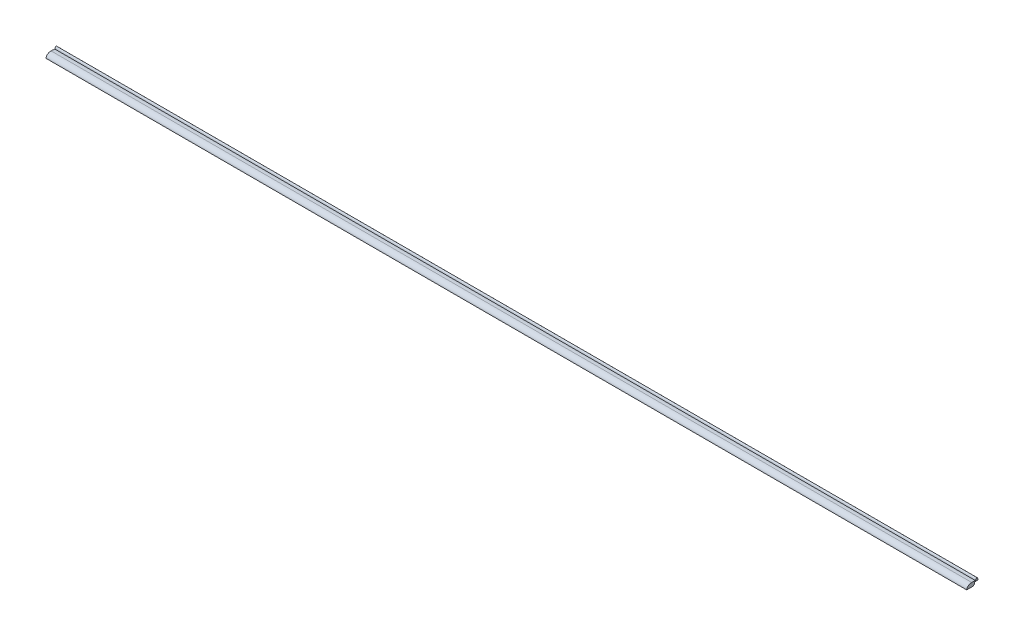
ISO-10303-21;
HEADER;
FILE_DESCRIPTION(('STEP AP214'),'2;1');
FILE_NAME('part.step','',(''),(''),'','','');
FILE_SCHEMA(('AUTOMOTIVE_DESIGN { 1 0 10303 214 1 1 1 1 }'));
ENDSEC;
DATA;
#1=APPLICATION_CONTEXT('core data for automotive mechanical design processes');
#2=APPLICATION_PROTOCOL_DEFINITION('international standard','automotive_design',2000,#1);
#3=PRODUCT_CONTEXT('',#1,'mechanical');
#4=PRODUCT('Part','Part','',(#3));
#5=PRODUCT_RELATED_PRODUCT_CATEGORY('part','',(#4));
#6=PRODUCT_DEFINITION_FORMATION('','',#4);
#7=PRODUCT_DEFINITION_CONTEXT('part definition',#1,'design');
#8=PRODUCT_DEFINITION('design','',#6,#7);
#9=PRODUCT_DEFINITION_SHAPE('','',#8);
#10=(LENGTH_UNIT() NAMED_UNIT(*) SI_UNIT(.MILLI.,.METRE.));
#11=(NAMED_UNIT(*) PLANE_ANGLE_UNIT() SI_UNIT($,.RADIAN.));
#12=(NAMED_UNIT(*) SI_UNIT($,.STERADIAN.) SOLID_ANGLE_UNIT());
#13=UNCERTAINTY_MEASURE_WITH_UNIT(LENGTH_MEASURE(1.E-05),#10,'distance_accuracy_value','');
#14=(GEOMETRIC_REPRESENTATION_CONTEXT(3) GLOBAL_UNCERTAINTY_ASSIGNED_CONTEXT((#13)) GLOBAL_UNIT_ASSIGNED_CONTEXT((#10,
#11,#12)) REPRESENTATION_CONTEXT('',''));
#15=CARTESIAN_POINT('',(0.,0.,0.));
#16=DIRECTION('',(0.,0.,1.));
#17=DIRECTION('',(1.,0.,0.));
#18=AXIS2_PLACEMENT_3D('',#15,#16,#17);
#19=CARTESIAN_POINT('',(113.203,0.,0.429499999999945));
#20=DIRECTION('',(1.,0.,0.));
#21=DIRECTION('',(0.,0.,1.));
#22=AXIS2_PLACEMENT_3D('',#19,#20,#21);
#23=ELLIPSE('',#22,1.23949999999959,0.97);
#24=DIRECTION('',(-1.,0.,0.));
#25=VECTOR('',#24,1.);
#26=SURFACE_OF_LINEAR_EXTRUSION('',#23,#25);
#27=CARTESIAN_POINT('',(-113.203,0.,0.429499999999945));
#28=DIRECTION('',(1.,0.,0.));
#29=DIRECTION('',(0.,0.,1.));
#30=AXIS2_PLACEMENT_3D('',#27,#28,#29);
#31=ELLIPSE('',#30,1.23949999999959,0.97);
#32=CARTESIAN_POINT('',(-113.203,0.97,0.429499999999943));
#33=VERTEX_POINT('',#32);
#34=CARTESIAN_POINT('',(-113.203,0.,1.66899999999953));
#35=VERTEX_POINT('',#34);
#36=EDGE_CURVE('E164',#33,#35,#31,.T.);
#37=ORIENTED_EDGE('',*,*,#36,.T.);
#38=DIRECTION('',(-1.,0.,0.));
#39=VECTOR('',#38,1.);
#40=CARTESIAN_POINT('',(113.203,0.,1.66899999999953));
#41=LINE('',#40,#39);
#42=CARTESIAN_POINT('',(113.203,0.,1.66899999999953));
#43=VERTEX_POINT('',#42);
#44=EDGE_CURVE('E11',#43,#35,#41,.T.);
#45=ORIENTED_EDGE('',*,*,#44,.F.);
#46=CARTESIAN_POINT('',(113.203,0.97,0.429499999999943));
#47=VERTEX_POINT('',#46);
#48=EDGE_CURVE('E182',#47,#43,#23,.T.);
#49=ORIENTED_EDGE('',*,*,#48,.F.);
#50=DIRECTION('',(-1.,0.,0.));
#51=VECTOR('',#50,1.);
#52=CARTESIAN_POINT('',(113.203,0.97,0.429499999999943));
#53=LINE('',#52,#51);
#54=EDGE_CURVE('E124',#47,#33,#53,.T.);
#55=ORIENTED_EDGE('',*,*,#54,.T.);
#56=EDGE_LOOP('',(#37,#45,#49,#55));
#57=FACE_BOUND('',#56,.T.);
#58=ADVANCED_FACE('F31',(#57),#26,.F.);
#59=CARTESIAN_POINT('',(113.203,0.,1.66899999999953));
#60=DIRECTION('',(0.,1.,0.));
#61=DIRECTION('',(0.,0.,1.));
#62=AXIS2_PLACEMENT_3D('',#59,#60,#61);
#63=PLANE('',#62);
#64=DIRECTION('',(0.,0.,-1.));
#65=VECTOR('',#64,1.);
#66=CARTESIAN_POINT('',(-113.203,0.,1.66899999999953));
#67=LINE('',#66,#65);
#68=CARTESIAN_POINT('',(-113.203,0.,0.));
#69=VERTEX_POINT('',#68);
#70=EDGE_CURVE('E155',#35,#69,#67,.T.);
#71=ORIENTED_EDGE('',*,*,#70,.T.);
#72=DIRECTION('',(-1.,0.,0.));
#73=VECTOR('',#72,1.);
#74=CARTESIAN_POINT('',(113.203,0.,0.));
#75=LINE('',#74,#73);
#76=CARTESIAN_POINT('',(113.203,0.,0.));
#77=VERTEX_POINT('',#76);
#78=EDGE_CURVE('E40',#77,#69,#75,.T.);
#79=ORIENTED_EDGE('',*,*,#78,.F.);
#80=DIRECTION('',(0.,0.,-1.));
#81=VECTOR('',#80,1.);
#82=CARTESIAN_POINT('',(113.203,0.,1.66899999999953));
#83=LINE('',#82,#81);
#84=EDGE_CURVE('E91',#43,#77,#83,.T.);
#85=ORIENTED_EDGE('',*,*,#84,.F.);
#86=ORIENTED_EDGE('',*,*,#44,.T.);
#87=EDGE_LOOP('',(#71,#79,#85,#86));
#88=FACE_BOUND('',#87,.T.);
#89=ADVANCED_FACE('F148',(#88),#63,.F.);
#90=CARTESIAN_POINT('',(113.203,0.,0.));
#91=DIRECTION('',(0.,0.,1.));
#92=DIRECTION('',(1.,0.,0.));
#93=AXIS2_PLACEMENT_3D('',#90,#91,#92);
#94=PLANE('',#93);
#95=DIRECTION('',(0.,1.,0.));
#96=VECTOR('',#95,1.);
#97=CARTESIAN_POINT('',(-113.203,0.,0.));
#98=LINE('',#97,#96);
#99=CARTESIAN_POINT('',(-113.203,0.22,0.));
#100=VERTEX_POINT('',#99);
#101=EDGE_CURVE('E163',#69,#100,#98,.T.);
#102=ORIENTED_EDGE('',*,*,#101,.T.);
#103=DIRECTION('',(-1.,0.,0.));
#104=VECTOR('',#103,1.);
#105=CARTESIAN_POINT('',(113.203,0.22,0.));
#106=LINE('',#105,#104);
#107=CARTESIAN_POINT('',(113.203,0.22,0.));
#108=VERTEX_POINT('',#107);
#109=EDGE_CURVE('E169',#108,#100,#106,.T.);
#110=ORIENTED_EDGE('',*,*,#109,.F.);
#111=DIRECTION('',(0.,1.,0.));
#112=VECTOR('',#111,1.);
#113=CARTESIAN_POINT('',(113.203,0.,0.));
#114=LINE('',#113,#112);
#115=EDGE_CURVE('E168',#77,#108,#114,.T.);
#116=ORIENTED_EDGE('',*,*,#115,.F.);
#117=ORIENTED_EDGE('',*,*,#78,.T.);
#118=EDGE_LOOP('',(#102,#110,#116,#117));
#119=FACE_BOUND('',#118,.T.);
#120=ADVANCED_FACE('F145',(#119),#94,.F.);
#121=CARTESIAN_POINT('',(113.203,0.22,0.));
#122=DIRECTION('',(0.,1.,0.));
#123=DIRECTION('',(0.,0.,1.));
#124=AXIS2_PLACEMENT_3D('',#121,#122,#123);
#125=PLANE('',#124);
#126=DIRECTION('',(0.,0.,-1.));
#127=VECTOR('',#126,1.);
#128=CARTESIAN_POINT('',(-113.203,0.22,0.));
#129=LINE('',#128,#127);
#130=CARTESIAN_POINT('',(-113.203,0.22,-0.209999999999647));
#131=VERTEX_POINT('',#130);
#132=EDGE_CURVE('E173',#100,#131,#129,.T.);
#133=ORIENTED_EDGE('',*,*,#132,.T.);
#134=DIRECTION('',(-1.,0.,0.));
#135=VECTOR('',#134,1.);
#136=CARTESIAN_POINT('',(113.203,0.22,-0.209999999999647));
#137=LINE('',#136,#135);
#138=CARTESIAN_POINT('',(113.203,0.22,-0.209999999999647));
#139=VERTEX_POINT('',#138);
#140=EDGE_CURVE('E186',#139,#131,#137,.T.);
#141=ORIENTED_EDGE('',*,*,#140,.F.);
#142=DIRECTION('',(0.,0.,-1.));
#143=VECTOR('',#142,1.);
#144=CARTESIAN_POINT('',(113.203,0.22,0.));
#145=LINE('',#144,#143);
#146=EDGE_CURVE('E191',#108,#139,#145,.T.);
#147=ORIENTED_EDGE('',*,*,#146,.F.);
#148=ORIENTED_EDGE('',*,*,#109,.T.);
#149=EDGE_LOOP('',(#133,#141,#147,#148));
#150=FACE_BOUND('',#149,.T.);
#151=ADVANCED_FACE('F141',(#150),#125,.F.);
#152=CARTESIAN_POINT('',(113.203,0.22,-0.209999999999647));
#153=DIRECTION('',(0.,0.,1.));
#154=DIRECTION('',(0.,-1.,0.));
#155=AXIS2_PLACEMENT_3D('',#152,#153,#154);
#156=PLANE('',#155);
#157=DIRECTION('',(0.,1.,0.));
#158=VECTOR('',#157,1.);
#159=CARTESIAN_POINT('',(-113.203,0.22,-0.209999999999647));
#160=LINE('',#159,#158);
#161=CARTESIAN_POINT('',(-113.203,0.72,-0.209999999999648));
#162=VERTEX_POINT('',#161);
#163=EDGE_CURVE('E175',#131,#162,#160,.T.);
#164=ORIENTED_EDGE('',*,*,#163,.T.);
#165=DIRECTION('',(-1.,0.,0.));
#166=VECTOR('',#165,1.);
#167=CARTESIAN_POINT('',(113.203,0.72,-0.209999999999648));
#168=LINE('',#167,#166);
#169=CARTESIAN_POINT('',(113.203,0.72,-0.209999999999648));
#170=VERTEX_POINT('',#169);
#171=EDGE_CURVE('E119',#170,#162,#168,.T.);
#172=ORIENTED_EDGE('',*,*,#171,.F.);
#173=DIRECTION('',(0.,1.,0.));
#174=VECTOR('',#173,1.);
#175=CARTESIAN_POINT('',(113.203,0.22,-0.209999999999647));
#176=LINE('',#175,#174);
#177=EDGE_CURVE('E110',#139,#170,#176,.T.);
#178=ORIENTED_EDGE('',*,*,#177,.F.);
#179=ORIENTED_EDGE('',*,*,#140,.T.);
#180=EDGE_LOOP('',(#164,#172,#178,#179));
#181=FACE_BOUND('',#180,.T.);
#182=ADVANCED_FACE('F138',(#181),#156,.F.);
#183=CARTESIAN_POINT('',(113.203,0.72,-0.209999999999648));
#184=DIRECTION('',(0.,1.,0.));
#185=DIRECTION('',(0.,0.,1.));
#186=AXIS2_PLACEMENT_3D('',#183,#184,#185);
#187=PLANE('',#186);
#188=DIRECTION('',(0.,0.,-1.));
#189=VECTOR('',#188,1.);
#190=CARTESIAN_POINT('',(-113.203,0.72,-0.209999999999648));
#191=LINE('',#190,#189);
#192=CARTESIAN_POINT('',(-113.203,0.72,-1.10999999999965));
#193=VERTEX_POINT('',#192);
#194=EDGE_CURVE('E118',#162,#193,#191,.T.);
#195=ORIENTED_EDGE('',*,*,#194,.T.);
#196=DIRECTION('',(-1.,0.,0.));
#197=VECTOR('',#196,1.);
#198=CARTESIAN_POINT('',(113.203,0.72,-1.10999999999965));
#199=LINE('',#198,#197);
#200=CARTESIAN_POINT('',(113.203,0.72,-1.10999999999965));
#201=VERTEX_POINT('',#200);
#202=EDGE_CURVE('E115',#201,#193,#199,.T.);
#203=ORIENTED_EDGE('',*,*,#202,.F.);
#204=DIRECTION('',(0.,0.,-1.));
#205=VECTOR('',#204,1.);
#206=CARTESIAN_POINT('',(113.203,0.72,-0.209999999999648));
#207=LINE('',#206,#205);
#208=EDGE_CURVE('E104',#170,#201,#207,.T.);
#209=ORIENTED_EDGE('',*,*,#208,.F.);
#210=ORIENTED_EDGE('',*,*,#171,.T.);
#211=EDGE_LOOP('',(#195,#203,#209,#210));
#212=FACE_BOUND('',#211,.T.);
#213=ADVANCED_FACE('F116',(#212),#187,.F.);
#214=CARTESIAN_POINT('',(113.203,0.72,-0.809999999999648));
#215=DIRECTION('',(1.,0.,0.));
#216=DIRECTION('',(0.,1.,0.));
#217=AXIS2_PLACEMENT_3D('',#214,#215,#216);
#218=ELLIPSE('',#217,0.64,0.300000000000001);
#219=DIRECTION('',(-1.,0.,0.));
#220=VECTOR('',#219,1.);
#221=SURFACE_OF_LINEAR_EXTRUSION('',#218,#220);
#222=CARTESIAN_POINT('',(-113.203,0.72,-0.809999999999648));
#223=DIRECTION('',(1.,0.,0.));
#224=DIRECTION('',(0.,1.,0.));
#225=AXIS2_PLACEMENT_3D('',#222,#223,#224);
#226=ELLIPSE('',#225,0.64,0.300000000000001);
#227=CARTESIAN_POINT('',(-113.203,0.880790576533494,-0.519622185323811));
#228=VERTEX_POINT('',#227);
#229=EDGE_CURVE('E77',#193,#228,#226,.T.);
#230=ORIENTED_EDGE('',*,*,#229,.T.);
#231=DIRECTION('',(-1.,0.,0.));
#232=VECTOR('',#231,1.);
#233=CARTESIAN_POINT('',(113.203,0.880790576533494,-0.519622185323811));
#234=LINE('',#233,#232);
#235=CARTESIAN_POINT('',(113.203,0.880790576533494,-0.519622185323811));
#236=VERTEX_POINT('',#235);
#237=EDGE_CURVE('E120',#236,#228,#234,.T.);
#238=ORIENTED_EDGE('',*,*,#237,.F.);
#239=EDGE_CURVE('E108',#201,#236,#218,.T.);
#240=ORIENTED_EDGE('',*,*,#239,.F.);
#241=ORIENTED_EDGE('',*,*,#202,.T.);
#242=EDGE_LOOP('',(#230,#238,#240,#241));
#243=FACE_BOUND('',#242,.T.);
#244=ADVANCED_FACE('F122',(#243),#221,.F.);
#245=CARTESIAN_POINT('',(113.203,0.72,0.429499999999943));
#246=DIRECTION('',(1.,0.,0.));
#247=DIRECTION('',(0.,0.,-1.));
#248=AXIS2_PLACEMENT_3D('',#245,#246,#247);
#249=ELLIPSE('',#248,1.23949999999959,0.25);
#250=DIRECTION('',(-1.,0.,0.));
#251=VECTOR('',#250,1.);
#252=SURFACE_OF_LINEAR_EXTRUSION('',#249,#251);
#253=CARTESIAN_POINT('',(-113.203,0.72,0.429499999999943));
#254=DIRECTION('',(1.,0.,0.));
#255=DIRECTION('',(0.,0.,-1.));
#256=AXIS2_PLACEMENT_3D('',#253,#254,#255);
#257=ELLIPSE('',#256,1.23949999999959,0.25);
#258=EDGE_CURVE('E83',#228,#33,#257,.T.);
#259=ORIENTED_EDGE('',*,*,#258,.T.);
#260=ORIENTED_EDGE('',*,*,#54,.F.);
#261=EDGE_CURVE('E48',#236,#47,#249,.T.);
#262=ORIENTED_EDGE('',*,*,#261,.F.);
#263=ORIENTED_EDGE('',*,*,#237,.T.);
#264=EDGE_LOOP('',(#259,#260,#262,#263));
#265=FACE_BOUND('',#264,.T.);
#266=ADVANCED_FACE('F134',(#265),#252,.F.);
#267=CARTESIAN_POINT('',(113.203,0.,0.429499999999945));
#268=DIRECTION('',(-1.,0.,0.));
#269=DIRECTION('',(0.,0.,1.));
#270=AXIS2_PLACEMENT_3D('',#267,#268,#269);
#271=PLANE('',#270);
#272=ORIENTED_EDGE('',*,*,#48,.T.);
#273=ORIENTED_EDGE('',*,*,#84,.T.);
#274=ORIENTED_EDGE('',*,*,#115,.T.);
#275=ORIENTED_EDGE('',*,*,#146,.T.);
#276=ORIENTED_EDGE('',*,*,#177,.T.);
#277=ORIENTED_EDGE('',*,*,#208,.T.);
#278=ORIENTED_EDGE('',*,*,#239,.T.);
#279=ORIENTED_EDGE('',*,*,#261,.T.);
#280=EDGE_LOOP('',(#272,#273,#274,#275,#276,#277,#278,#279));
#281=FACE_BOUND('',#280,.T.);
#282=ADVANCED_FACE('F106',(#281),#271,.F.);
#283=CARTESIAN_POINT('',(-113.203,0.,0.429499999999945));
#284=DIRECTION('',(-1.,0.,0.));
#285=DIRECTION('',(0.,0.,1.));
#286=AXIS2_PLACEMENT_3D('',#283,#284,#285);
#287=PLANE('',#286);
#288=ORIENTED_EDGE('',*,*,#36,.F.);
#289=ORIENTED_EDGE('',*,*,#258,.F.);
#290=ORIENTED_EDGE('',*,*,#229,.F.);
#291=ORIENTED_EDGE('',*,*,#194,.F.);
#292=ORIENTED_EDGE('',*,*,#163,.F.);
#293=ORIENTED_EDGE('',*,*,#132,.F.);
#294=ORIENTED_EDGE('',*,*,#101,.F.);
#295=ORIENTED_EDGE('',*,*,#70,.F.);
#296=EDGE_LOOP('',(#288,#289,#290,#291,#292,#293,#294,#295));
#297=FACE_BOUND('',#296,.T.);
#298=ADVANCED_FACE('F171',(#297),#287,.T.);
#299=CLOSED_SHELL('',(#58,#89,#120,#151,#182,#213,#244,#266,#282,#298));
#300=MANIFOLD_SOLID_BREP('B2',#299);
#301=ADVANCED_BREP_SHAPE_REPRESENTATION('',(#18,#300),#14);
#302=SHAPE_DEFINITION_REPRESENTATION(#9,#301);
ENDSEC;
END-ISO-10303-21;
